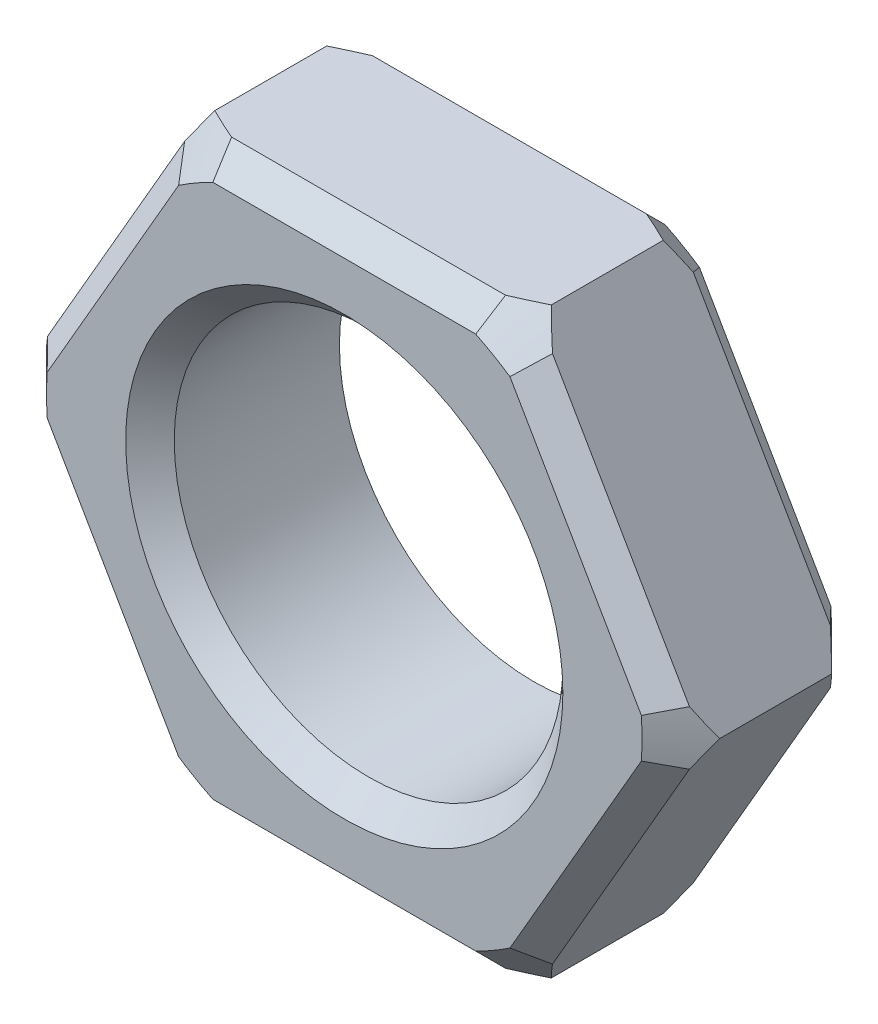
from build123d import *

# Parameters (mm, degrees)
SKETCH_1_R      = 8
EXTRUDE_1_DEPTH = 7.8
CHAMFER_1_SIZE  = 1


with BuildPart() as part:
    # Sketch 1 → Extrude 1 (new body)
    with BuildSketch(Plane.XY):
        Polygon((-6.92820323, -12), (6.92820323, -12), (13.856406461, 0), (6.92820323, 12), (-6.92820323, 12), (-13.856406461, 0), align=None)
        Circle(SKETCH_1_R, mode=Mode.SUBTRACT)
    extrude(amount=EXTRUDE_1_DEPTH)

    # Chamfer 1
    chamfer_1_edges = [part.edges().sort_by_distance(p)[0] for p in [
        (10.392304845, -6, 7.8),
        (10.392304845, 6, 7.8),
        (0, 12, 7.8),
        (-8, 0, 7.8),
        (-10.392304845, 6, 7.8),
        (-10.392304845, -6, 7.8),
        (-10.392304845, 6, 0),
        (0, 12, 0),
        (10.392304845, 6, 0),
        (0, -12, 7.8),
        (10.392304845, -6, 0),
        (0, -12, 0),
        (-10.392304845, -6, 0),
    ]]
    chamfer(chamfer_1_edges, length=CHAMFER_1_SIZE)

    # Sketch 2 → Cut-Revolve 1 (revolve, cut)
    with BuildSketch(Plane(origin=(0, 0, 0), x_dir=(1, 0, 0), z_dir=(0, 1, 0))):
        Polygon((-11.362693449, 0.896430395), (-14.259123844, -2), (-14.259123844, -5.8), (-11.615276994, -8.44384685), (-16.698807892, -8.44384685), (-16.698807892, 0.896430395), align=None)
    revolve(axis=Axis((0, 0, -2.189920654), (0, 0, 1)), mode=Mode.SUBTRACT)


solid = part.part
